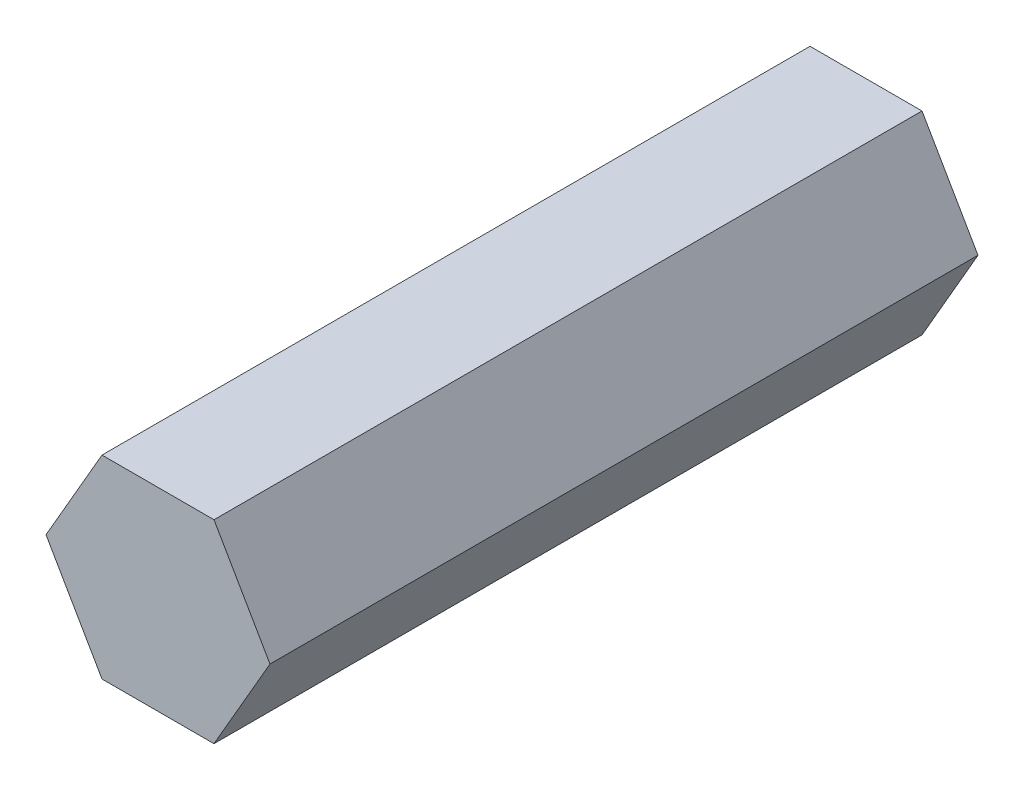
ISO-10303-21;
HEADER;
FILE_DESCRIPTION(('STEP AP214'),'2;1');
FILE_NAME('part.step','',(''),(''),'','','');
FILE_SCHEMA(('AUTOMOTIVE_DESIGN { 1 0 10303 214 1 1 1 1 }'));
ENDSEC;
DATA;
#1=APPLICATION_CONTEXT('core data for automotive mechanical design processes');
#2=APPLICATION_PROTOCOL_DEFINITION('international standard','automotive_design',2000,#1);
#3=PRODUCT_CONTEXT('',#1,'mechanical');
#4=PRODUCT('Part','Part','',(#3));
#5=PRODUCT_RELATED_PRODUCT_CATEGORY('part','',(#4));
#6=PRODUCT_DEFINITION_FORMATION('','',#4);
#7=PRODUCT_DEFINITION_CONTEXT('part definition',#1,'design');
#8=PRODUCT_DEFINITION('design','',#6,#7);
#9=PRODUCT_DEFINITION_SHAPE('','',#8);
#10=(LENGTH_UNIT() NAMED_UNIT(*) SI_UNIT(.MILLI.,.METRE.));
#11=(NAMED_UNIT(*) PLANE_ANGLE_UNIT() SI_UNIT($,.RADIAN.));
#12=(NAMED_UNIT(*) SI_UNIT($,.STERADIAN.) SOLID_ANGLE_UNIT());
#13=UNCERTAINTY_MEASURE_WITH_UNIT(LENGTH_MEASURE(1.E-05),#10,'distance_accuracy_value','');
#14=(GEOMETRIC_REPRESENTATION_CONTEXT(3) GLOBAL_UNCERTAINTY_ASSIGNED_CONTEXT((#13)) GLOBAL_UNIT_ASSIGNED_CONTEXT((#10,
#11,#12)) REPRESENTATION_CONTEXT('',''));
#15=CARTESIAN_POINT('',(0.,0.,0.));
#16=DIRECTION('',(0.,0.,1.));
#17=DIRECTION('',(1.,0.,0.));
#18=AXIS2_PLACEMENT_3D('',#15,#16,#17);
#19=CARTESIAN_POINT('',(1.15470053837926,-2.,-20.7101009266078));
#20=DIRECTION('',(0.86602540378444,-0.499999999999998,0.));
#21=DIRECTION('',(0.499999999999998,0.86602540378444,0.));
#22=AXIS2_PLACEMENT_3D('',#19,#20,#21);
#23=PLANE('',#22);
#24=DIRECTION('',(-0.499999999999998,-0.86602540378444,0.));
#25=VECTOR('',#24,1.);
#26=CARTESIAN_POINT('',(1.15470053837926,-2.,-14.6));
#27=LINE('',#26,#25);
#28=CARTESIAN_POINT('',(2.3094010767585,0.,-14.6));
#29=VERTEX_POINT('',#28);
#30=CARTESIAN_POINT('',(1.15470053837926,-2.,-14.6));
#31=VERTEX_POINT('',#30);
#32=EDGE_CURVE('E38',#29,#31,#27,.T.);
#33=ORIENTED_EDGE('',*,*,#32,.F.);
#34=DIRECTION('',(0.,0.,1.));
#35=VECTOR('',#34,1.);
#36=CARTESIAN_POINT('',(2.3094010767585,0.,-20.7101009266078));
#37=LINE('',#36,#35);
#38=CARTESIAN_POINT('',(2.3094010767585,0.,0.));
#39=VERTEX_POINT('',#38);
#40=EDGE_CURVE('E94',#29,#39,#37,.T.);
#41=ORIENTED_EDGE('',*,*,#40,.T.);
#42=DIRECTION('',(0.499999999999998,0.86602540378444,0.));
#43=VECTOR('',#42,1.);
#44=CARTESIAN_POINT('',(1.15470053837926,-2.,0.));
#45=LINE('',#44,#43);
#46=CARTESIAN_POINT('',(1.15470053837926,-2.,0.));
#47=VERTEX_POINT('',#46);
#48=EDGE_CURVE('E119',#47,#39,#45,.T.);
#49=ORIENTED_EDGE('',*,*,#48,.F.);
#50=DIRECTION('',(0.,0.,1.));
#51=VECTOR('',#50,1.);
#52=CARTESIAN_POINT('',(1.15470053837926,-2.,-20.7101009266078));
#53=LINE('',#52,#51);
#54=EDGE_CURVE('E87',#31,#47,#53,.T.);
#55=ORIENTED_EDGE('',*,*,#54,.F.);
#56=EDGE_LOOP('',(#33,#41,#49,#55));
#57=FACE_BOUND('',#56,.T.);
#58=ADVANCED_FACE('F30',(#57),#23,.T.);
#59=CARTESIAN_POINT('',(-1.15470053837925,-2.,-20.7101009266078));
#60=DIRECTION('',(0.,-1.,0.));
#61=DIRECTION('',(1.,0.,0.));
#62=AXIS2_PLACEMENT_3D('',#59,#60,#61);
#63=PLANE('',#62);
#64=DIRECTION('',(-1.,0.,0.));
#65=VECTOR('',#64,1.);
#66=CARTESIAN_POINT('',(-1.15470053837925,-2.,-14.6));
#67=LINE('',#66,#65);
#68=CARTESIAN_POINT('',(-1.15470053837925,-2.,-14.6));
#69=VERTEX_POINT('',#68);
#70=EDGE_CURVE('E63',#31,#69,#67,.T.);
#71=ORIENTED_EDGE('',*,*,#70,.F.);
#72=ORIENTED_EDGE('',*,*,#54,.T.);
#73=DIRECTION('',(1.,0.,0.));
#74=VECTOR('',#73,1.);
#75=CARTESIAN_POINT('',(-1.15470053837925,-2.,0.));
#76=LINE('',#75,#74);
#77=CARTESIAN_POINT('',(-1.15470053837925,-2.,0.));
#78=VERTEX_POINT('',#77);
#79=EDGE_CURVE('E96',#78,#47,#76,.T.);
#80=ORIENTED_EDGE('',*,*,#79,.F.);
#81=DIRECTION('',(0.,0.,1.));
#82=VECTOR('',#81,1.);
#83=CARTESIAN_POINT('',(-1.15470053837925,-2.,-20.7101009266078));
#84=LINE('',#83,#82);
#85=EDGE_CURVE('E85',#69,#78,#84,.T.);
#86=ORIENTED_EDGE('',*,*,#85,.F.);
#87=EDGE_LOOP('',(#71,#72,#80,#86));
#88=FACE_BOUND('',#87,.T.);
#89=ADVANCED_FACE('F137',(#88),#63,.T.);
#90=CARTESIAN_POINT('',(-2.3094010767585,0.,-20.7101009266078));
#91=DIRECTION('',(-0.86602540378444,-0.499999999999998,0.));
#92=DIRECTION('',(0.499999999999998,-0.86602540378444,0.));
#93=AXIS2_PLACEMENT_3D('',#90,#91,#92);
#94=PLANE('',#93);
#95=DIRECTION('',(-0.499999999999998,0.86602540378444,0.));
#96=VECTOR('',#95,1.);
#97=CARTESIAN_POINT('',(-2.3094010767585,0.,-14.6));
#98=LINE('',#97,#96);
#99=CARTESIAN_POINT('',(-2.3094010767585,0.,-14.6));
#100=VERTEX_POINT('',#99);
#101=EDGE_CURVE('E57',#69,#100,#98,.T.);
#102=ORIENTED_EDGE('',*,*,#101,.F.);
#103=ORIENTED_EDGE('',*,*,#85,.T.);
#104=DIRECTION('',(0.499999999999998,-0.86602540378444,0.));
#105=VECTOR('',#104,1.);
#106=CARTESIAN_POINT('',(-2.3094010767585,0.,0.));
#107=LINE('',#106,#105);
#108=CARTESIAN_POINT('',(-2.3094010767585,0.,0.));
#109=VERTEX_POINT('',#108);
#110=EDGE_CURVE('E83',#109,#78,#107,.T.);
#111=ORIENTED_EDGE('',*,*,#110,.F.);
#112=DIRECTION('',(0.,0.,1.));
#113=VECTOR('',#112,1.);
#114=CARTESIAN_POINT('',(-2.3094010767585,0.,-20.7101009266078));
#115=LINE('',#114,#113);
#116=EDGE_CURVE('E75',#100,#109,#115,.T.);
#117=ORIENTED_EDGE('',*,*,#116,.F.);
#118=EDGE_LOOP('',(#102,#103,#111,#117));
#119=FACE_BOUND('',#118,.T.);
#120=ADVANCED_FACE('F81',(#119),#94,.T.);
#121=CARTESIAN_POINT('',(-1.15470053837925,2.,-20.7101009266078));
#122=DIRECTION('',(-0.86602540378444,0.499999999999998,0.));
#123=DIRECTION('',(-0.499999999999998,-0.86602540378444,0.));
#124=AXIS2_PLACEMENT_3D('',#121,#122,#123);
#125=PLANE('',#124);
#126=DIRECTION('',(0.499999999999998,0.86602540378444,0.));
#127=VECTOR('',#126,1.);
#128=CARTESIAN_POINT('',(-1.15470053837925,2.,-14.6));
#129=LINE('',#128,#127);
#130=CARTESIAN_POINT('',(-1.15470053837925,2.,-14.6));
#131=VERTEX_POINT('',#130);
#132=EDGE_CURVE('E60',#100,#131,#129,.T.);
#133=ORIENTED_EDGE('',*,*,#132,.F.);
#134=ORIENTED_EDGE('',*,*,#116,.T.);
#135=DIRECTION('',(-0.499999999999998,-0.86602540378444,0.));
#136=VECTOR('',#135,1.);
#137=CARTESIAN_POINT('',(-1.15470053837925,2.,0.));
#138=LINE('',#137,#136);
#139=CARTESIAN_POINT('',(-1.15470053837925,2.,0.));
#140=VERTEX_POINT('',#139);
#141=EDGE_CURVE('E108',#140,#109,#138,.T.);
#142=ORIENTED_EDGE('',*,*,#141,.F.);
#143=DIRECTION('',(0.,0.,1.));
#144=VECTOR('',#143,1.);
#145=CARTESIAN_POINT('',(-1.15470053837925,2.,-20.7101009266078));
#146=LINE('',#145,#144);
#147=EDGE_CURVE('E78',#131,#140,#146,.T.);
#148=ORIENTED_EDGE('',*,*,#147,.F.);
#149=EDGE_LOOP('',(#133,#134,#142,#148));
#150=FACE_BOUND('',#149,.T.);
#151=ADVANCED_FACE('F72',(#150),#125,.T.);
#152=CARTESIAN_POINT('',(1.15470053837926,2.,-20.7101009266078));
#153=DIRECTION('',(0.,1.,0.));
#154=DIRECTION('',(-1.,0.,0.));
#155=AXIS2_PLACEMENT_3D('',#152,#153,#154);
#156=PLANE('',#155);
#157=DIRECTION('',(1.,0.,0.));
#158=VECTOR('',#157,1.);
#159=CARTESIAN_POINT('',(1.15470053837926,2.,-14.6));
#160=LINE('',#159,#158);
#161=CARTESIAN_POINT('',(1.15470053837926,2.,-14.6));
#162=VERTEX_POINT('',#161);
#163=EDGE_CURVE('E79',#131,#162,#160,.T.);
#164=ORIENTED_EDGE('',*,*,#163,.F.);
#165=ORIENTED_EDGE('',*,*,#147,.T.);
#166=DIRECTION('',(-1.,0.,0.));
#167=VECTOR('',#166,1.);
#168=CARTESIAN_POINT('',(1.15470053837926,2.,0.));
#169=LINE('',#168,#167);
#170=CARTESIAN_POINT('',(1.15470053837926,2.,0.));
#171=VERTEX_POINT('',#170);
#172=EDGE_CURVE('E124',#171,#140,#169,.T.);
#173=ORIENTED_EDGE('',*,*,#172,.F.);
#174=DIRECTION('',(0.,0.,1.));
#175=VECTOR('',#174,1.);
#176=CARTESIAN_POINT('',(1.15470053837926,2.,-20.7101009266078));
#177=LINE('',#176,#175);
#178=EDGE_CURVE('E89',#162,#171,#177,.T.);
#179=ORIENTED_EDGE('',*,*,#178,.F.);
#180=EDGE_LOOP('',(#164,#165,#173,#179));
#181=FACE_BOUND('',#180,.T.);
#182=ADVANCED_FACE('F140',(#181),#156,.T.);
#183=CARTESIAN_POINT('',(2.3094010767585,0.,-20.7101009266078));
#184=DIRECTION('',(0.86602540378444,0.499999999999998,0.));
#185=DIRECTION('',(-0.499999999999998,0.86602540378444,0.));
#186=AXIS2_PLACEMENT_3D('',#183,#184,#185);
#187=PLANE('',#186);
#188=DIRECTION('',(0.499999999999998,-0.86602540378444,0.));
#189=VECTOR('',#188,1.);
#190=CARTESIAN_POINT('',(2.3094010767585,0.,-14.6));
#191=LINE('',#190,#189);
#192=EDGE_CURVE('E11',#162,#29,#191,.T.);
#193=ORIENTED_EDGE('',*,*,#192,.F.);
#194=ORIENTED_EDGE('',*,*,#178,.T.);
#195=DIRECTION('',(-0.499999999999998,0.86602540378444,0.));
#196=VECTOR('',#195,1.);
#197=CARTESIAN_POINT('',(2.3094010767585,0.,0.));
#198=LINE('',#197,#196);
#199=EDGE_CURVE('E121',#39,#171,#198,.T.);
#200=ORIENTED_EDGE('',*,*,#199,.F.);
#201=ORIENTED_EDGE('',*,*,#40,.F.);
#202=EDGE_LOOP('',(#193,#194,#200,#201));
#203=FACE_BOUND('',#202,.T.);
#204=ADVANCED_FACE('F139',(#203),#187,.T.);
#205=CARTESIAN_POINT('',(1.15470053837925,-2.,0.));
#206=DIRECTION('',(0.,0.,-1.));
#207=DIRECTION('',(-1.,0.,0.));
#208=AXIS2_PLACEMENT_3D('',#205,#206,#207);
#209=PLANE('',#208);
#210=ORIENTED_EDGE('',*,*,#48,.T.);
#211=ORIENTED_EDGE('',*,*,#199,.T.);
#212=ORIENTED_EDGE('',*,*,#172,.T.);
#213=ORIENTED_EDGE('',*,*,#141,.T.);
#214=ORIENTED_EDGE('',*,*,#110,.T.);
#215=ORIENTED_EDGE('',*,*,#79,.T.);
#216=EDGE_LOOP('',(#210,#211,#212,#213,#214,#215));
#217=FACE_BOUND('',#216,.T.);
#218=ADVANCED_FACE('F126',(#217),#209,.F.);
#219=CARTESIAN_POINT('',(0.,0.,-14.6));
#220=DIRECTION('',(0.,0.,1.));
#221=DIRECTION('',(1.,0.,0.));
#222=AXIS2_PLACEMENT_3D('',#219,#220,#221);
#223=PLANE('',#222);
#224=ORIENTED_EDGE('',*,*,#32,.T.);
#225=ORIENTED_EDGE('',*,*,#70,.T.);
#226=ORIENTED_EDGE('',*,*,#101,.T.);
#227=ORIENTED_EDGE('',*,*,#132,.T.);
#228=ORIENTED_EDGE('',*,*,#163,.T.);
#229=ORIENTED_EDGE('',*,*,#192,.T.);
#230=EDGE_LOOP('',(#224,#225,#226,#227,#228,#229));
#231=FACE_BOUND('',#230,.T.);
#232=ADVANCED_FACE('F59',(#231),#223,.F.);
#233=CLOSED_SHELL('',(#58,#89,#120,#151,#182,#204,#218,#232));
#234=MANIFOLD_SOLID_BREP('B2',#233);
#235=ADVANCED_BREP_SHAPE_REPRESENTATION('',(#18,#234),#14);
#236=SHAPE_DEFINITION_REPRESENTATION(#9,#235);
ENDSEC;
END-ISO-10303-21;
